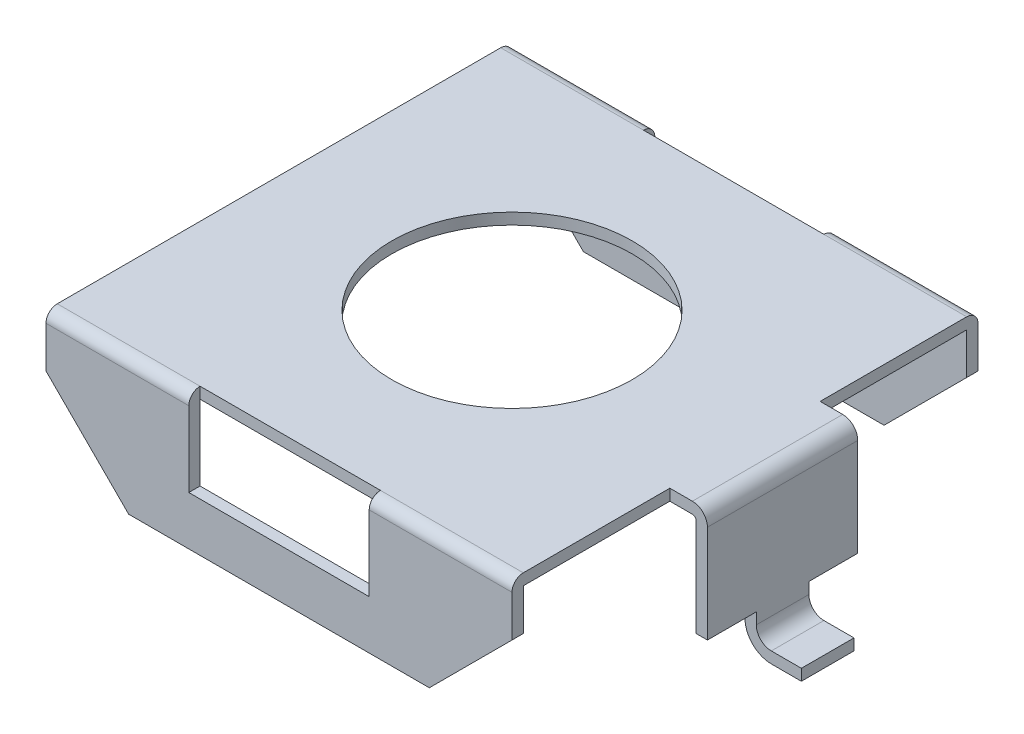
from build123d import *

# Parameters (mm, degrees)
EXTRUDE_THIN3_DEPTH     = 3.1
CUT_EXTRUDE1_DEPTH      = 5.818713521
CUT_EXTRUDE1_DEPTH_BACK = 5.818713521
SKETCH2_W               = 2.4
SKETCH2_H               = 1
SKETCH3_W               = 2.4
SKETCH3_H               = 0.15
CUT_EXTRUDE2_DEPTH      = 1
FILLET1_R               = 0.15
SKETCH4_R               = 1.6
CUT_EXTRUDE3_DEPTH      = 1
EXTRUDE_THIN4_DEPTH     = 1
SKETCH6_W               = 1
SKETCH6_H               = 0.65
CUT_EXTRUDE4_DEPTH      = 0.5


with BuildPart() as part:
    # Sketch1 → Extrude-Thin3 (new, symmetric)
    with BuildSketch(Plane(origin=(0, 0, 0), x_dir=(0, 0, -1), z_dir=(1, 0, 0))):
        Polygon((-3.1, 0.2), (-3.1, 2), (3.1, 2), (3.1, 0.2), (2.95, 0.2), (2.95, 1.85), (-2.95, 1.85), (-2.95, 0.2), align=None)
    extrude(amount=EXTRUDE_THIN3_DEPTH, both=True)

    # Sketch2 → Cut-Extrude1 (cut, two sides: drawn at the far end of the back side and taken through both)
    with BuildSketch(Plane.XY.offset(-CUT_EXTRUDE1_DEPTH_BACK)):
        with Locations((0, 1.35)):
            Rectangle(SKETCH2_W, SKETCH2_H)
        Polygon((-3.1, 1.3), (-2, 0.2), (-3.1, 0.2), align=None)
        Polygon((3.1, 0.2), (3.1, 1.3), (2, 0.2), align=None)
    extrude(amount=CUT_EXTRUDE1_DEPTH + CUT_EXTRUDE1_DEPTH_BACK, mode=Mode.SUBTRACT)

    # Sketch3 → Cut-Extrude2 (cut)
    with BuildSketch(Plane(origin=(0, 2, 0), x_dir=(1, 0, 0), z_dir=(0, 1, 0))):
        with Locations((0, 3.025)):
            Rectangle(SKETCH3_W, SKETCH3_H)
        with Locations((0, -3.025)):
            Rectangle(SKETCH3_W, SKETCH3_H)
    extrude(amount=-CUT_EXTRUDE2_DEPTH, mode=Mode.SUBTRACT)

    # Fillet1
    fillet1_edges = [part.edges().sort_by_distance(p)[0] for p in [
        (-2.15, 2, -3.1),
        (2.15, 2, -3.1),
        (-2.15, 2, 3.1),
        (2.15, 2, 3.1),
    ]]
    fillet(fillet1_edges, radius=FILLET1_R)

    # Sketch4 → Cut-Extrude3 (cut)
    with BuildSketch(Plane(origin=(0, 2, 0), x_dir=(1, 0, 0), z_dir=(0, 1, 0))):
        with Locations(Location((0, 0, 0), (0, 0, 270))):
            Circle(SKETCH4_R)
    extrude(amount=-CUT_EXTRUDE3_DEPTH, mode=Mode.SUBTRACT)

    # Sketch5 → Extrude-Thin4 (add, symmetric)
    with BuildSketch(Plane.XY):
        with BuildLine():
            Line((3.1, 2), (3.4, 2))
            ThreePointArc((3.4, 2), (3.541421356, 1.941421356), (3.6, 1.8))
            Line((3.6, 1.8), (3.6, 0.35))
            ThreePointArc((3.6, 0.35), (3.658578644, 0.208578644), (3.8, 0.15))
            Line((3.8, 0.15), (4.2, 0.15))
            Line((4.2, 0.15), (4.2, 0))
            Line((4.2, 0), (3.8, 0))
            ThreePointArc((3.8, 0), (3.552512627, 0.102512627), (3.45, 0.35))
            Line((3.45, 0.35), (3.45, 1.8))
            ThreePointArc((3.45, 1.8), (3.435355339, 1.835355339), (3.4, 1.85))
            Line((3.4, 1.85), (3.1, 1.85))
            Line((3.1, 1.85), (3.1, 2))
        make_face()
    extrude(amount=EXTRUDE_THIN4_DEPTH, both=True)

    # Sketch6 → Cut-Extrude4 (cut)
    with BuildSketch(Plane.XZ):
        with Locations((3.7, 0.675)):
            Rectangle(SKETCH6_W, SKETCH6_H)
        with Locations((3.7, -0.675)):
            Rectangle(SKETCH6_W, SKETCH6_H)
    extrude(amount=-CUT_EXTRUDE4_DEPTH, mode=Mode.SUBTRACT)


solid = part.part
